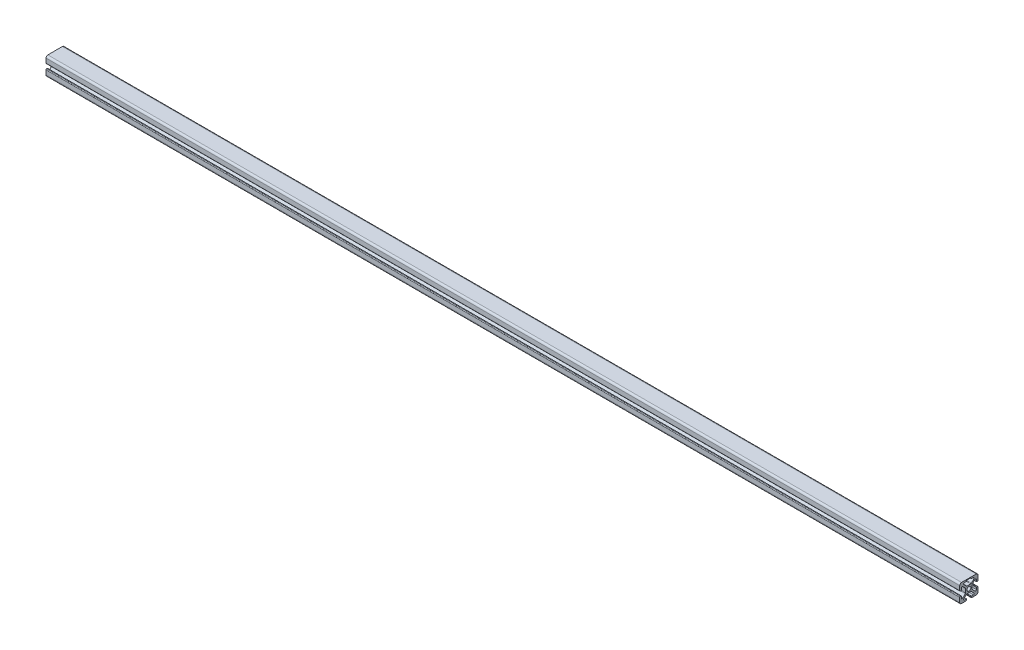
from build123d import *

# Parameters (mm, degrees)
MODEL_R                = 2.15
STRUKTURBAUTEIL1_DEPTH = 1000


with BuildPart() as part:
    # Model → Strukturbauteil1 (new body)
    with BuildSketch(Plane(origin=(0, 0, 0), x_dir=(0, 0, -1), z_dir=(1, 0, 0))):
        with BuildLine():
            Line((-8.5, -2.5), (-9.3, -2.5))
            ThreePointArc((-9.3, -2.5), (-9.794974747, -2.705025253), (-10, -3.2))
            Line((-10, -3.2), (-10, -8))
            ThreePointArc((-10, -8), (-9.414213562, -9.414213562), (-8, -10))
            Line((-8, -10), (-3.2, -10))
            ThreePointArc((-3.2, -10), (-2.705025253, -9.794974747), (-2.5, -9.3))
            Line((-2.5, -9.3), (-2.5, -8.5))
            ThreePointArc((-2.5, -8.5), (-2.587867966, -8.287867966), (-2.8, -8.2))
            Line((-2.8, -8.2), (-4.867588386, -8.2))
            ThreePointArc((-4.867588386, -8.2), (-5.682830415, -7.655272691), (-5.491547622, -6.69362915))
            Line((-5.491547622, -6.69362915), (-2.740811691, -3.942893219))
            ThreePointArc((-2.740811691, -3.942893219), (-2.416388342, -3.726120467), (-2.03370491, -3.65))
            Line((-2.03370491, -3.65), (2.03370491, -3.65))
            ThreePointArc((2.03370491, -3.65), (2.416388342, -3.726120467), (2.740811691, -3.942893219))
            Line((2.740811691, -3.942893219), (5.491547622, -6.69362915))
            ThreePointArc((5.491547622, -6.69362915), (5.682830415, -7.655272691), (4.867588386, -8.2))
            Line((4.867588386, -8.2), (2.8, -8.2))
            ThreePointArc((2.8, -8.2), (2.587867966, -8.287867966), (2.5, -8.5))
            Line((2.5, -8.5), (2.5, -9.3))
            ThreePointArc((2.5, -9.3), (2.705025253, -9.794974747), (3.2, -10))
            Line((3.2, -10), (8, -10))
            ThreePointArc((8, -10), (9.414213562, -9.414213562), (10, -8))
            Line((10, -8), (10, -3.2))
            ThreePointArc((10, -3.2), (9.794974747, -2.705025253), (9.3, -2.5))
            Line((9.3, -2.5), (8.5, -2.5))
            ThreePointArc((8.5, -2.5), (8.287867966, -2.587867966), (8.2, -2.8))
            Line((8.2, -2.8), (8.2, -4.867588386))
            ThreePointArc((8.2, -4.867588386), (7.655272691, -5.682830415), (6.69362915, -5.491547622))
            Line((6.69362915, -5.491547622), (3.942893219, -2.740811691))
            ThreePointArc((3.942893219, -2.740811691), (3.726120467, -2.416388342), (3.65, -2.03370491))
            Line((3.65, -2.03370491), (3.65, 2.03370491))
            ThreePointArc((3.65, 2.03370491), (3.726120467, 2.416388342), (3.942893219, 2.740811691))
            Line((3.942893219, 2.740811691), (6.69362915, 5.491547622))
            ThreePointArc((6.69362915, 5.491547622), (7.655272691, 5.682830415), (8.2, 4.867588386))
            Line((8.2, 4.867588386), (8.2, 2.8))
            ThreePointArc((8.2, 2.8), (8.287867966, 2.587867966), (8.5, 2.5))
            Line((8.5, 2.5), (9.3, 2.5))
            ThreePointArc((9.3, 2.5), (9.794974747, 2.705025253), (10, 3.2))
            Line((10, 3.2), (10, 8))
            ThreePointArc((10, 8), (9.414213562, 9.414213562), (8, 10))
            Line((8, 10), (-8, 10))
            ThreePointArc((-8, 10), (-9.414213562, 9.414213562), (-10, 8))
            Line((-10, 8), (-10, 3.2))
            ThreePointArc((-10, 3.2), (-9.794974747, 2.705025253), (-9.3, 2.5))
            Line((-9.3, 2.5), (-8.5, 2.5))
            ThreePointArc((-8.5, 2.5), (-8.287867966, 2.587867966), (-8.2, 2.8))
            Line((-8.2, 2.8), (-8.2, 4.867588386))
            ThreePointArc((-8.2, 4.867588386), (-7.655272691, 5.682830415), (-6.69362915, 5.491547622))
            Line((-6.69362915, 5.491547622), (-3.942893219, 2.740811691))
            ThreePointArc((-3.942893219, 2.740811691), (-3.726120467, 2.416388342), (-3.65, 2.03370491))
            Line((-3.65, 2.03370491), (-3.65, -2.03370491))
            ThreePointArc((-3.65, -2.03370491), (-3.726120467, -2.416388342), (-3.942893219, -2.740811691))
            Line((-3.942893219, -2.740811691), (-6.69362915, -5.491547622))
            ThreePointArc((-6.69362915, -5.491547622), (-7.655272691, -5.682830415), (-8.2, -4.867588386))
            Line((-8.2, -4.867588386), (-8.2, -2.8))
            ThreePointArc((-8.2, -2.8), (-8.287867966, -2.587867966), (-8.5, -2.5))
        make_face()
        Circle(MODEL_R, mode=Mode.SUBTRACT)
        with BuildLine():
            Line((2.5, 9), (2.5, 8.5))
            ThreePointArc((2.5, 8.5), (2.587867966, 8.287867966), (2.8, 8.2))
            Line((2.8, 8.2), (4.867588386, 8.2))
            ThreePointArc((4.867588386, 8.2), (5.682830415, 7.655272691), (5.491547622, 6.69362915))
            Line((5.491547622, 6.69362915), (2.740811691, 3.942893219))
            ThreePointArc((2.740811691, 3.942893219), (2.416388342, 3.726120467), (2.03370491, 3.65))
            Line((2.03370491, 3.65), (-2.03370491, 3.65))
            ThreePointArc((-2.03370491, 3.65), (-2.416388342, 3.726120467), (-2.740811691, 3.942893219))
            Line((-2.740811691, 3.942893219), (-5.491547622, 6.69362915))
            ThreePointArc((-5.491547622, 6.69362915), (-5.682830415, 7.655272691), (-4.867588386, 8.2))
            Line((-4.867588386, 8.2), (-2.8, 8.2))
            ThreePointArc((-2.8, 8.2), (-2.587867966, 8.287867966), (-2.5, 8.5))
            Line((-2.5, 8.5), (-2.5, 9))
            ThreePointArc((-2.5, 9), (-2.412132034, 9.212132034), (-2.2, 9.3))
            Line((-2.2, 9.3), (2.2, 9.3))
            ThreePointArc((2.2, 9.3), (2.412132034, 9.212132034), (2.5, 9))
        make_face(mode=Mode.SUBTRACT)
    extrude(amount=STRUKTURBAUTEIL1_DEPTH)


solid = part.part
